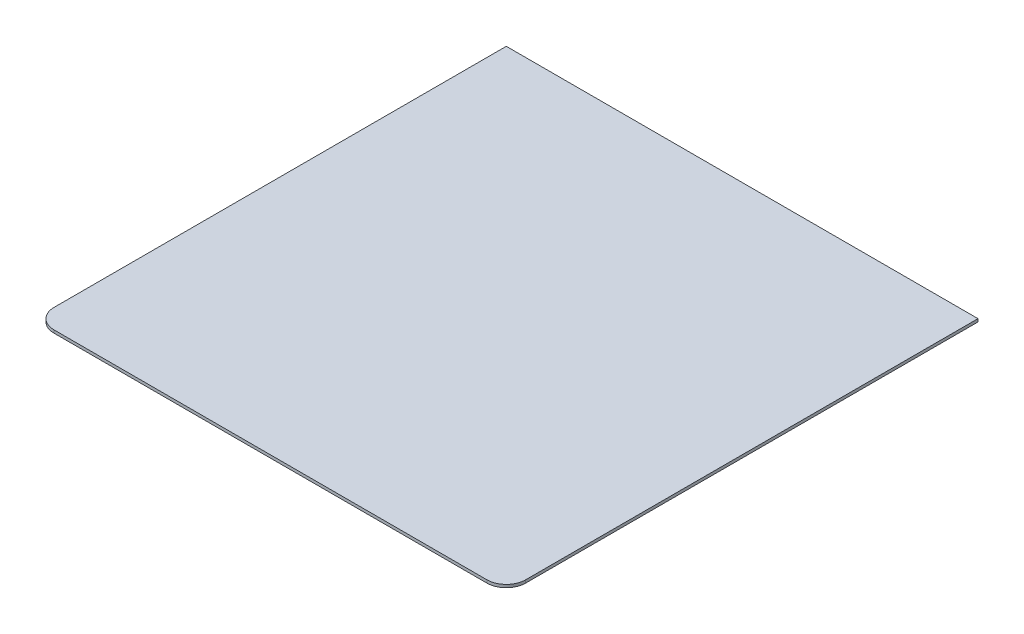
from build123d import *

# Parameters (mm, degrees)
BOSS_EXTRUDE1_DEPTH = 3


with BuildPart() as part:
    # Sketch1 → Boss-Extrude1 (new body)
    with BuildSketch(Plane(origin=(0, 0, 0), x_dir=(1, 0, 0), z_dir=(0, 1, 0))):
        with BuildLine():
            Line((20.179460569, 0), (469.820539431, 0))
            ThreePointArc((469.820539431, 0), (484.08957284, 5.91042716), (490, 20.179460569))
            Line((490, 20.179460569), (490, 490))
            Line((490, 490), (0, 490))
            Line((0, 490), (0, 20.179460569))
            ThreePointArc((0, 20.179460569), (5.91042716, 5.91042716), (20.179460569, 0))
        make_face()
    extrude(amount=BOSS_EXTRUDE1_DEPTH)


solid = part.part
